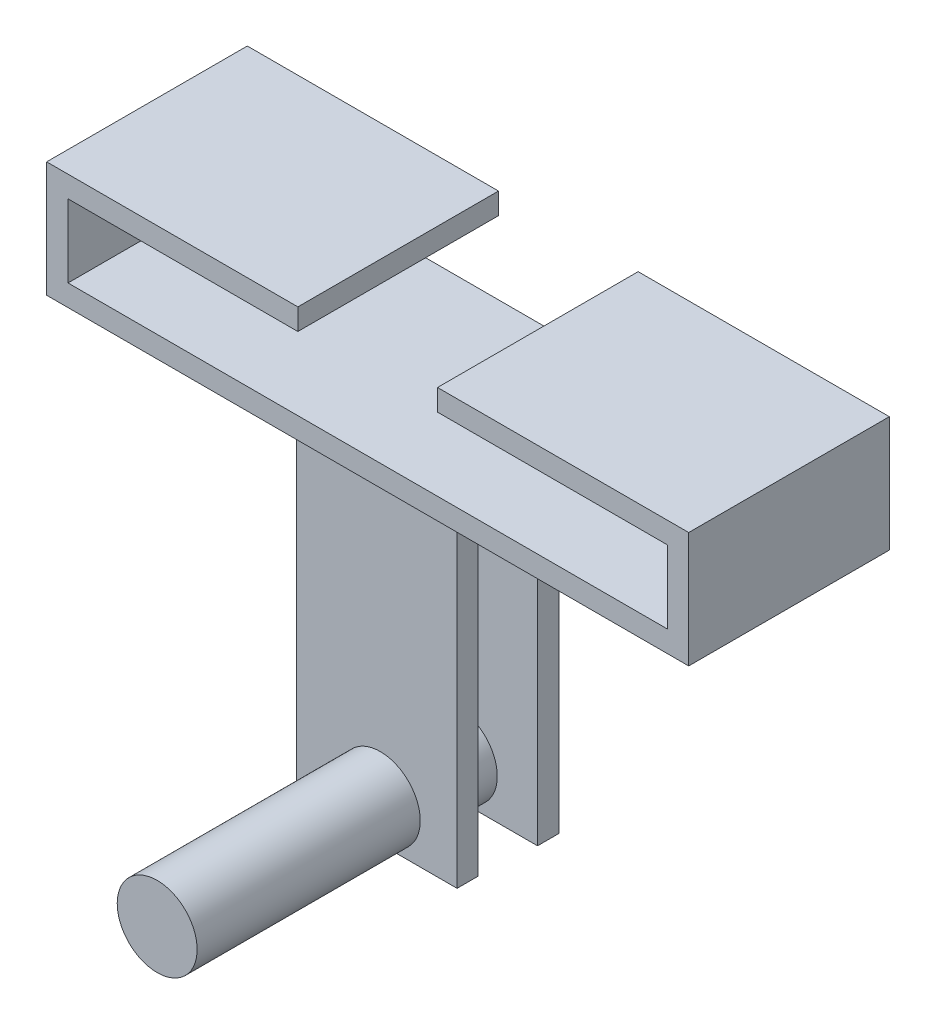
from build123d import *

# Parameters (mm, degrees)
SKETCH1_W           = 101.6
SKETCH1_H           = 31.75
BOSS_EXTRUDE1_DEPTH = 18.288
SKETCH2_W           = 22.098
SKETCH2_H           = 31.75
CUT_EXTRUDE1_DEPTH  = 14.9098
SKETCH3_W           = 36.3728
SKETCH3_H           = 11.5316
CUT_EXTRUDE2_DEPTH  = 109.004969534
SKETCH4_W           = 25.37968
SKETCH4_H           = 3.3782
BOSS_EXTRUDE2_DEPTH = 50.8
BOSS_EXTRUDE3_DEPTH = 47.498
BOSS_EXTRUDE4_DEPTH = 47.498
SKETCH10_W          = 25.4
SKETCH10_H          = 3.302
BOSS_EXTRUDE5_DEPTH = 50.8


with BuildPart() as part:
    # Sketch1 → Boss-Extrude1 (new body)
    with BuildSketch(Plane(origin=(0, 0, 0), x_dir=(1, 0, 0), z_dir=(0, 1, 0))):
        with Locations((50.8, 15.875)):
            Rectangle(SKETCH1_W, SKETCH1_H)
    extrude(amount=BOSS_EXTRUDE1_DEPTH)

    # Sketch2 → Cut-Extrude1 (cut)
    with BuildSketch(Plane(origin=(0, 18.288, 0), x_dir=(1, 0, 0), z_dir=(0, 1, 0))):
        with Locations((50.8, 15.875)):
            Rectangle(SKETCH2_W, SKETCH2_H)
    extrude(amount=-CUT_EXTRUDE1_DEPTH, mode=Mode.SUBTRACT)

    # Sketch3 → Cut-Extrude2 (cut, through all)
    with BuildSketch(Plane.XY):
        with Locations((21.5646, 9.144)):
            Rectangle(SKETCH3_W, SKETCH3_H)
        with Locations((80.0354, 9.144)):
            Rectangle(SKETCH3_W, SKETCH3_H)
    extrude(amount=-CUT_EXTRUDE2_DEPTH, mode=Mode.SUBTRACT)

    # Sketch4 → Boss-Extrude2 (add)
    with BuildSketch(Plane.XZ):
        with Locations((50.8, -15.875)):
            Rectangle(SKETCH4_W, SKETCH4_H)
    extrude(amount=BOSS_EXTRUDE2_DEPTH)

    # Sketch5 → Boss-Extrude3 (add)
    with BuildSketch(Plane.XY.offset(-14.1859)):
        with BuildLine():
            Line((44.4754, -44.45), (57.1246, -44.45))
            ThreePointArc((57.1246, -44.45), (50.8, -38.1254), (44.4754, -44.45))
        make_face()
    extrude(amount=BOSS_EXTRUDE3_DEPTH)

    # Sketch8 → Boss-Extrude4 (add)
    with BuildSketch(Plane.XY.offset(-14.1859)):
        with BuildLine():
            Line((44.4754, -44.45), (57.1246, -44.45))
            ThreePointArc((57.1246, -44.45), (50.8, -50.7746), (44.4754, -44.45))
        make_face()
    extrude(amount=BOSS_EXTRUDE4_DEPTH)

    # Sketch10 → Boss-Extrude5 (add)
    with BuildSketch(Plane.XZ):
        with Locations((50.252154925, -3.6449)):
            Rectangle(SKETCH10_W, SKETCH10_H)
    extrude(amount=BOSS_EXTRUDE5_DEPTH)


solid = part.part
